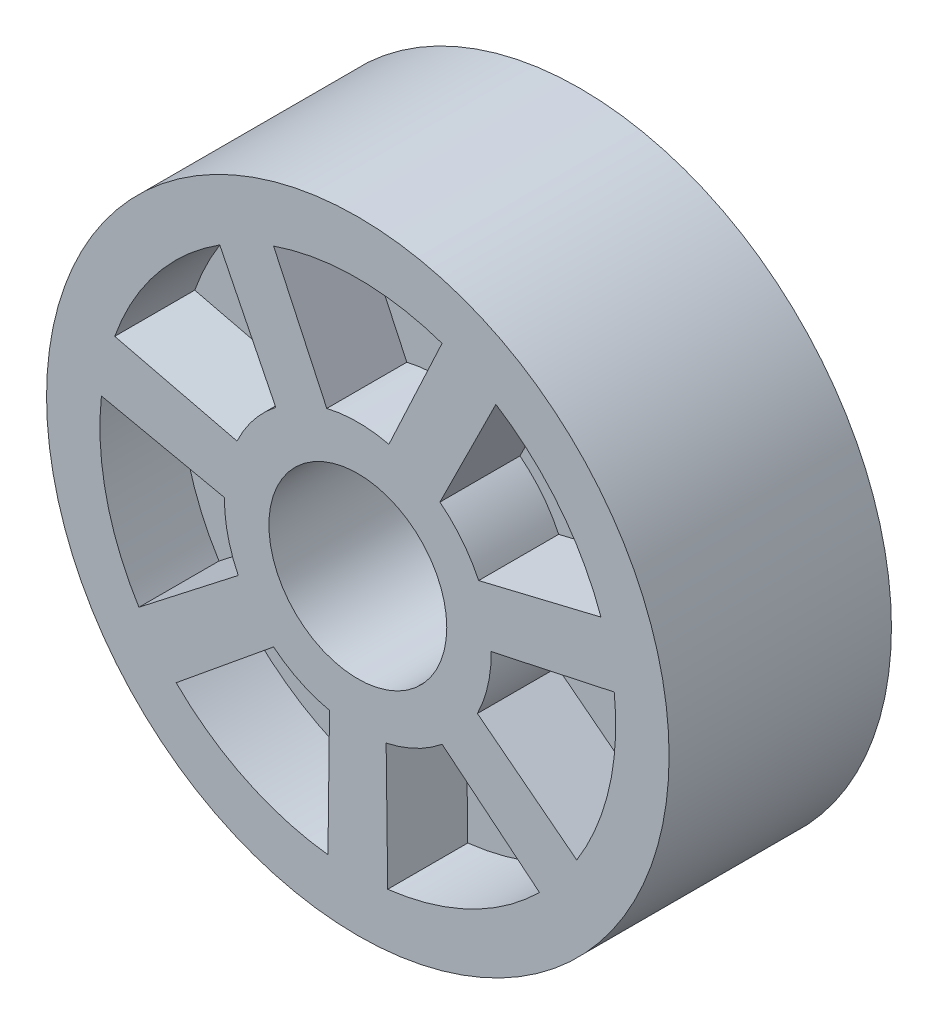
from build123d import *

# Parameters (mm, degrees)
SKIZZE1_R                       = 35
SKIZZE1_R_2                     = 10
LINEAR_AUSTRAGEN1_DEPTH         = 12.5
SCHNITT_LINEAR_AUSTRAGEN1_DEPTH = 9
SCHNITT_LINEAR_START            = -9
SCHNITT_LINEAR_AUSTRAGEN2_DEPTH = 9
KREISMUSTER1_COUNT              = 7


with BuildPart() as part:
    # Skizze1 → Linear austragen1 (new, symmetric)
    with BuildSketch(Plane.XY):
        Circle(SKIZZE1_R)
        Circle(SKIZZE1_R_2, mode=Mode.SUBTRACT)
    extrude(amount=LINEAR_AUSTRAGEN1_DEPTH, both=True)

    # Skizze2 → Schnitt-Linear austragen1 (cut)
    with BuildSketch(Plane.XY.offset(12.5)):
        with BuildLine():
            Line((3.492271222, 14.587804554), (9.47125114, 27.409768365))
            ThreePointArc((9.47125114, 27.409768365), (0, 29), (-9.47125114, 27.409768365))
            Line((-9.47125114, 27.409768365), (-3.492271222, 14.587804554))
            ThreePointArc((-3.492271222, 14.587804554), (0, 15), (3.492271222, 14.587804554))
        make_face()
    schnitt_linear_austragen1 = extrude(amount=-SCHNITT_LINEAR_AUSTRAGEN1_DEPTH, mode=Mode.SUBTRACT)

    # Skizze3 → Schnitt-Linear austragen2 (cut)
    with BuildSketch(Plane(origin=(0, 0, -12.5), x_dir=(-1, 0, 0), z_dir=(0, 0, -1)).offset(SCHNITT_LINEAR_START)):
        with BuildLine():
            Line((-9.47125114, 27.409768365), (-3.492271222, 14.587804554))
            ThreePointArc((-3.492271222, 14.587804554), (0, 15), (3.492271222, 14.587804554))
            Line((3.492271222, 14.587804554), (9.47125114, 27.409768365))
            ThreePointArc((9.47125114, 27.409768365), (0, 29), (-9.47125114, 27.409768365))
        make_face()
    schnitt_linear_austragen2 = extrude(amount=SCHNITT_LINEAR_AUSTRAGEN2_DEPTH, mode=Mode.SUBTRACT)

    # Kreismuster1: Schnitt-Linear austragen1, Schnitt-Linear austragen2 ×7 about axis
    kreismuster1_axis = Axis((0, 0, 0), (0, 0, 1))
    add([schnitt_linear_austragen1.rotate(kreismuster1_axis, i * 360 / KREISMUSTER1_COUNT) for i in range(1, KREISMUSTER1_COUNT)], mode=Mode.SUBTRACT)
    add([schnitt_linear_austragen2.rotate(kreismuster1_axis, i * 360 / KREISMUSTER1_COUNT) for i in range(1, KREISMUSTER1_COUNT)], mode=Mode.SUBTRACT)


solid = part.part
